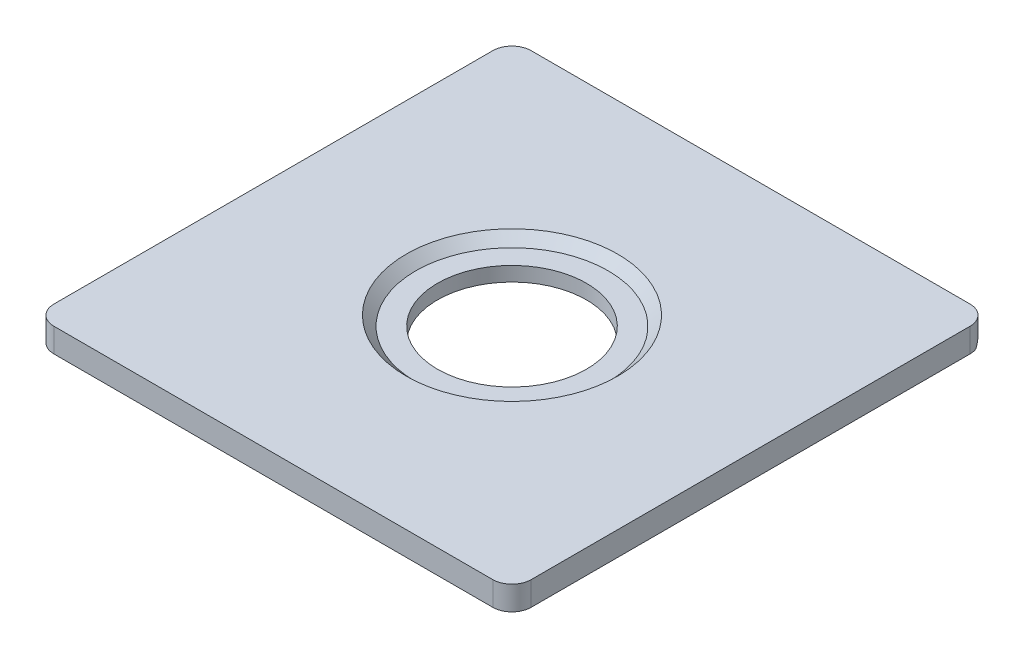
ISO-10303-21;
HEADER;
FILE_DESCRIPTION(('STEP AP214'),'2;1');
FILE_NAME('part.step','',(''),(''),'','','');
FILE_SCHEMA(('AUTOMOTIVE_DESIGN { 1 0 10303 214 1 1 1 1 }'));
ENDSEC;
DATA;
#1=APPLICATION_CONTEXT('core data for automotive mechanical design processes');
#2=APPLICATION_PROTOCOL_DEFINITION('international standard','automotive_design',2000,#1);
#3=PRODUCT_CONTEXT('',#1,'mechanical');
#4=PRODUCT('Part','Part','',(#3));
#5=PRODUCT_RELATED_PRODUCT_CATEGORY('part','',(#4));
#6=PRODUCT_DEFINITION_FORMATION('','',#4);
#7=PRODUCT_DEFINITION_CONTEXT('part definition',#1,'design');
#8=PRODUCT_DEFINITION('design','',#6,#7);
#9=PRODUCT_DEFINITION_SHAPE('','',#8);
#10=(LENGTH_UNIT() NAMED_UNIT(*) SI_UNIT(.MILLI.,.METRE.));
#11=(NAMED_UNIT(*) PLANE_ANGLE_UNIT() SI_UNIT($,.RADIAN.));
#12=(NAMED_UNIT(*) SI_UNIT($,.STERADIAN.) SOLID_ANGLE_UNIT());
#13=UNCERTAINTY_MEASURE_WITH_UNIT(LENGTH_MEASURE(1.E-05),#10,'distance_accuracy_value','');
#14=(GEOMETRIC_REPRESENTATION_CONTEXT(3) GLOBAL_UNCERTAINTY_ASSIGNED_CONTEXT((#13)) GLOBAL_UNIT_ASSIGNED_CONTEXT((#10,
#11,#12)) REPRESENTATION_CONTEXT('',''));
#15=CARTESIAN_POINT('',(0.,0.,0.));
#16=DIRECTION('',(0.,0.,1.));
#17=DIRECTION('',(1.,0.,0.));
#18=AXIS2_PLACEMENT_3D('',#15,#16,#17);
#19=CARTESIAN_POINT('',(0.,2.5,0.));
#20=DIRECTION('',(0.,-1.,0.));
#21=DIRECTION('',(0.,0.,-1.));
#22=AXIS2_PLACEMENT_3D('',#19,#20,#21);
#23=CYLINDRICAL_SURFACE('',#22,15.5);
#24=CARTESIAN_POINT('',(0.,-2.5,0.));
#25=DIRECTION('',(0.,1.,0.));
#26=DIRECTION('',(0.,0.,1.));
#27=AXIS2_PLACEMENT_3D('',#24,#25,#26);
#28=CIRCLE('',#27,15.5);
#29=CARTESIAN_POINT('',(0.,-2.5,15.5));
#30=VERTEX_POINT('',#29);
#31=EDGE_CURVE('E139',#30,#30,#28,.T.);
#32=ORIENTED_EDGE('',*,*,#31,.F.);
#33=EDGE_LOOP('',(#32));
#34=FACE_BOUND('',#33,.T.);
#35=CARTESIAN_POINT('',(0.,0.5,0.));
#36=DIRECTION('',(0.,1.,0.));
#37=DIRECTION('',(0.,0.,1.));
#38=AXIS2_PLACEMENT_3D('',#35,#36,#37);
#39=CIRCLE('',#38,15.5);
#40=CARTESIAN_POINT('',(0.,0.5,15.5));
#41=VERTEX_POINT('',#40);
#42=EDGE_CURVE('E143',#41,#41,#39,.T.);
#43=ORIENTED_EDGE('',*,*,#42,.T.);
#44=EDGE_LOOP('',(#43));
#45=FACE_BOUND('',#44,.T.);
#46=ADVANCED_FACE('F35',(#34,#45),#23,.F.);
#47=CARTESIAN_POINT('',(0.,2.5,0.));
#48=DIRECTION('',(0.,1.,0.));
#49=DIRECTION('',(0.,0.,1.));
#50=AXIS2_PLACEMENT_3D('',#47,#48,#49);
#51=PLANE('',#50);
#52=CARTESIAN_POINT('',(0.,2.5,0.));
#53=DIRECTION('',(0.,1.,0.));
#54=DIRECTION('',(0.,0.,1.));
#55=AXIS2_PLACEMENT_3D('',#52,#53,#54);
#56=CIRCLE('',#55,22.);
#57=CARTESIAN_POINT('',(0.,2.5,22.));
#58=VERTEX_POINT('',#57);
#59=EDGE_CURVE('E147',#58,#58,#56,.F.);
#60=ORIENTED_EDGE('',*,*,#59,.T.);
#61=EDGE_LOOP('',(#60));
#62=FACE_BOUND('',#61,.T.);
#63=DIRECTION('',(-1.,0.,0.));
#64=VECTOR('',#63,1.);
#65=CARTESIAN_POINT('',(-49.65,2.5,-49.65));
#66=LINE('',#65,#64);
#67=CARTESIAN_POINT('',(45.65,2.5,-49.65));
#68=VERTEX_POINT('',#67);
#69=CARTESIAN_POINT('',(-45.65,2.5,-49.65));
#70=VERTEX_POINT('',#69);
#71=EDGE_CURVE('E194',#68,#70,#66,.T.);
#72=ORIENTED_EDGE('',*,*,#71,.T.);
#73=CARTESIAN_POINT('',(-45.65,2.5,-45.65));
#74=DIRECTION('',(0.,1.,0.));
#75=DIRECTION('',(0.,0.,1.));
#76=AXIS2_PLACEMENT_3D('',#73,#74,#75);
#77=CIRCLE('',#76,4.);
#78=CARTESIAN_POINT('',(-49.65,2.5,-45.65));
#79=VERTEX_POINT('',#78);
#80=EDGE_CURVE('E173',#70,#79,#77,.T.);
#81=ORIENTED_EDGE('',*,*,#80,.T.);
#82=DIRECTION('',(0.,0.,1.));
#83=VECTOR('',#82,1.);
#84=CARTESIAN_POINT('',(-49.65,2.5,-49.65));
#85=LINE('',#84,#83);
#86=CARTESIAN_POINT('',(-49.65,2.5,45.65));
#87=VERTEX_POINT('',#86);
#88=EDGE_CURVE('E126',#79,#87,#85,.T.);
#89=ORIENTED_EDGE('',*,*,#88,.T.);
#90=CARTESIAN_POINT('',(-45.65,2.5,45.65));
#91=DIRECTION('',(0.,1.,0.));
#92=DIRECTION('',(0.,0.,1.));
#93=AXIS2_PLACEMENT_3D('',#90,#91,#92);
#94=CIRCLE('',#93,4.);
#95=CARTESIAN_POINT('',(-45.65,2.5,49.65));
#96=VERTEX_POINT('',#95);
#97=EDGE_CURVE('E55',#87,#96,#94,.T.);
#98=ORIENTED_EDGE('',*,*,#97,.T.);
#99=DIRECTION('',(1.,0.,0.));
#100=VECTOR('',#99,1.);
#101=CARTESIAN_POINT('',(-49.65,2.5,49.65));
#102=LINE('',#101,#100);
#103=CARTESIAN_POINT('',(45.65,2.5,49.65));
#104=VERTEX_POINT('',#103);
#105=EDGE_CURVE('E151',#96,#104,#102,.T.);
#106=ORIENTED_EDGE('',*,*,#105,.T.);
#107=CARTESIAN_POINT('',(45.65,2.5,45.65));
#108=DIRECTION('',(0.,1.,0.));
#109=DIRECTION('',(0.,0.,1.));
#110=AXIS2_PLACEMENT_3D('',#107,#108,#109);
#111=CIRCLE('',#110,4.);
#112=CARTESIAN_POINT('',(49.65,2.5,45.65));
#113=VERTEX_POINT('',#112);
#114=EDGE_CURVE('E169',#104,#113,#111,.T.);
#115=ORIENTED_EDGE('',*,*,#114,.T.);
#116=DIRECTION('',(0.,0.,-1.));
#117=VECTOR('',#116,1.);
#118=CARTESIAN_POINT('',(49.65,2.5,-49.65));
#119=LINE('',#118,#117);
#120=CARTESIAN_POINT('',(49.65,2.5,-45.65));
#121=VERTEX_POINT('',#120);
#122=EDGE_CURVE('E136',#113,#121,#119,.T.);
#123=ORIENTED_EDGE('',*,*,#122,.T.);
#124=CARTESIAN_POINT('',(45.65,2.5,-45.65));
#125=DIRECTION('',(0.,1.,0.));
#126=DIRECTION('',(0.,0.,1.));
#127=AXIS2_PLACEMENT_3D('',#124,#125,#126);
#128=CIRCLE('',#127,4.);
#129=EDGE_CURVE('E171',#121,#68,#128,.T.);
#130=ORIENTED_EDGE('',*,*,#129,.T.);
#131=EDGE_LOOP('',(#72,#81,#89,#98,#106,#115,#123,#130));
#132=FACE_BOUND('',#131,.T.);
#133=ADVANCED_FACE('F201',(#62,#132),#51,.T.);
#134=CARTESIAN_POINT('',(0.,-2.5,0.));
#135=DIRECTION('',(0.,1.,0.));
#136=DIRECTION('',(0.,0.,1.));
#137=AXIS2_PLACEMENT_3D('',#134,#135,#136);
#138=PLANE('',#137);
#139=DIRECTION('',(0.,0.,1.));
#140=VECTOR('',#139,1.);
#141=CARTESIAN_POINT('',(-49.65,-2.5,-49.65));
#142=LINE('',#141,#140);
#143=CARTESIAN_POINT('',(-49.65,-2.5,-45.65));
#144=VERTEX_POINT('',#143);
#145=CARTESIAN_POINT('',(-49.65,-2.5,45.65));
#146=VERTEX_POINT('',#145);
#147=EDGE_CURVE('E124',#144,#146,#142,.T.);
#148=ORIENTED_EDGE('',*,*,#147,.F.);
#149=CARTESIAN_POINT('',(-45.65,-2.5,-45.65));
#150=DIRECTION('',(0.,1.,0.));
#151=DIRECTION('',(0.,0.,1.));
#152=AXIS2_PLACEMENT_3D('',#149,#150,#151);
#153=CIRCLE('',#152,4.);
#154=CARTESIAN_POINT('',(-49.3580992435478,-2.5,-47.15));
#155=VERTEX_POINT('',#154);
#156=EDGE_CURVE('E106',#144,#155,#153,.F.);
#157=ORIENTED_EDGE('',*,*,#156,.T.);
#158=DIRECTION('',(1.,0.,0.));
#159=VECTOR('',#158,1.);
#160=CARTESIAN_POINT('',(0.,-2.5,-47.15));
#161=LINE('',#160,#159);
#162=CARTESIAN_POINT('',(49.3580992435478,-2.5,-47.15));
#163=VERTEX_POINT('',#162);
#164=EDGE_CURVE('E154',#155,#163,#161,.T.);
#165=ORIENTED_EDGE('',*,*,#164,.T.);
#166=CARTESIAN_POINT('',(45.65,-2.5,-45.65));
#167=DIRECTION('',(0.,1.,0.));
#168=DIRECTION('',(0.,0.,1.));
#169=AXIS2_PLACEMENT_3D('',#166,#167,#168);
#170=CIRCLE('',#169,4.);
#171=CARTESIAN_POINT('',(49.65,-2.5,-45.65));
#172=VERTEX_POINT('',#171);
#173=EDGE_CURVE('E118',#163,#172,#170,.F.);
#174=ORIENTED_EDGE('',*,*,#173,.T.);
#175=DIRECTION('',(0.,0.,-1.));
#176=VECTOR('',#175,1.);
#177=CARTESIAN_POINT('',(49.65,-2.5,-49.65));
#178=LINE('',#177,#176);
#179=CARTESIAN_POINT('',(49.65,-2.5,45.65));
#180=VERTEX_POINT('',#179);
#181=EDGE_CURVE('E134',#180,#172,#178,.T.);
#182=ORIENTED_EDGE('',*,*,#181,.F.);
#183=CARTESIAN_POINT('',(45.65,-2.5,45.65));
#184=DIRECTION('',(0.,1.,0.));
#185=DIRECTION('',(0.,0.,1.));
#186=AXIS2_PLACEMENT_3D('',#183,#184,#185);
#187=CIRCLE('',#186,4.);
#188=CARTESIAN_POINT('',(45.65,-2.5,49.65));
#189=VERTEX_POINT('',#188);
#190=EDGE_CURVE('E158',#180,#189,#187,.F.);
#191=ORIENTED_EDGE('',*,*,#190,.T.);
#192=DIRECTION('',(1.,0.,0.));
#193=VECTOR('',#192,1.);
#194=CARTESIAN_POINT('',(-49.65,-2.5,49.65));
#195=LINE('',#194,#193);
#196=CARTESIAN_POINT('',(-45.65,-2.5,49.65));
#197=VERTEX_POINT('',#196);
#198=EDGE_CURVE('E133',#197,#189,#195,.T.);
#199=ORIENTED_EDGE('',*,*,#198,.F.);
#200=CARTESIAN_POINT('',(-45.65,-2.5,45.65));
#201=DIRECTION('',(0.,1.,0.));
#202=DIRECTION('',(0.,0.,1.));
#203=AXIS2_PLACEMENT_3D('',#200,#201,#202);
#204=CIRCLE('',#203,4.);
#205=EDGE_CURVE('E127',#197,#146,#204,.F.);
#206=ORIENTED_EDGE('',*,*,#205,.T.);
#207=EDGE_LOOP('',(#148,#157,#165,#174,#182,#191,#199,#206));
#208=FACE_BOUND('',#207,.T.);
#209=ORIENTED_EDGE('',*,*,#31,.T.);
#210=EDGE_LOOP('',(#209));
#211=FACE_BOUND('',#210,.T.);
#212=ADVANCED_FACE('F130',(#208,#211),#138,.F.);
#213=CARTESIAN_POINT('',(49.65,2.5,-49.65));
#214=DIRECTION('',(-1.,0.,0.));
#215=DIRECTION('',(0.,0.,1.));
#216=AXIS2_PLACEMENT_3D('',#213,#214,#215);
#217=PLANE('',#216);
#218=ORIENTED_EDGE('',*,*,#181,.T.);
#219=DIRECTION('',(0.,-1.,0.));
#220=VECTOR('',#219,1.);
#221=CARTESIAN_POINT('',(49.65,2.5,-45.65));
#222=LINE('',#221,#220);
#223=EDGE_CURVE('E178',#172,#121,#222,.F.);
#224=ORIENTED_EDGE('',*,*,#223,.T.);
#225=ORIENTED_EDGE('',*,*,#122,.F.);
#226=DIRECTION('',(0.,-1.,0.));
#227=VECTOR('',#226,1.);
#228=CARTESIAN_POINT('',(49.65,2.5,45.65));
#229=LINE('',#228,#227);
#230=EDGE_CURVE('E175',#113,#180,#229,.T.);
#231=ORIENTED_EDGE('',*,*,#230,.T.);
#232=EDGE_LOOP('',(#218,#224,#225,#231));
#233=FACE_BOUND('',#232,.T.);
#234=ADVANCED_FACE('F190',(#233),#217,.F.);
#235=CARTESIAN_POINT('',(-49.65,2.5,-49.65));
#236=DIRECTION('',(0.,0.,1.));
#237=DIRECTION('',(1.,0.,0.));
#238=AXIS2_PLACEMENT_3D('',#235,#236,#237);
#239=PLANE('',#238);
#240=DIRECTION('',(-1.,0.,0.));
#241=VECTOR('',#240,1.);
#242=CARTESIAN_POINT('',(-49.65,0.,-49.65));
#243=LINE('',#242,#241);
#244=CARTESIAN_POINT('',(45.65,0.,-49.65));
#245=VERTEX_POINT('',#244);
#246=CARTESIAN_POINT('',(-45.65,0.,-49.65));
#247=VERTEX_POINT('',#246);
#248=EDGE_CURVE('E150',#245,#247,#243,.T.);
#249=ORIENTED_EDGE('',*,*,#248,.T.);
#250=DIRECTION('',(0.,-1.,0.));
#251=VECTOR('',#250,1.);
#252=CARTESIAN_POINT('',(-45.65,2.5,-49.65));
#253=LINE('',#252,#251);
#254=EDGE_CURVE('E166',#247,#70,#253,.F.);
#255=ORIENTED_EDGE('',*,*,#254,.T.);
#256=ORIENTED_EDGE('',*,*,#71,.F.);
#257=DIRECTION('',(0.,-1.,0.));
#258=VECTOR('',#257,1.);
#259=CARTESIAN_POINT('',(45.65,2.5,-49.65));
#260=LINE('',#259,#258);
#261=EDGE_CURVE('E163',#68,#245,#260,.T.);
#262=ORIENTED_EDGE('',*,*,#261,.T.);
#263=EDGE_LOOP('',(#249,#255,#256,#262));
#264=FACE_BOUND('',#263,.T.);
#265=ADVANCED_FACE('F220',(#264),#239,.F.);
#266=CARTESIAN_POINT('',(-49.65,2.5,-49.65));
#267=DIRECTION('',(1.,0.,0.));
#268=DIRECTION('',(0.,0.,-1.));
#269=AXIS2_PLACEMENT_3D('',#266,#267,#268);
#270=PLANE('',#269);
#271=ORIENTED_EDGE('',*,*,#88,.F.);
#272=DIRECTION('',(0.,-1.,0.));
#273=VECTOR('',#272,1.);
#274=CARTESIAN_POINT('',(-49.65,2.5,-45.65));
#275=LINE('',#274,#273);
#276=EDGE_CURVE('E110',#79,#144,#275,.T.);
#277=ORIENTED_EDGE('',*,*,#276,.T.);
#278=ORIENTED_EDGE('',*,*,#147,.T.);
#279=DIRECTION('',(0.,-1.,0.));
#280=VECTOR('',#279,1.);
#281=CARTESIAN_POINT('',(-49.65,2.5,45.65));
#282=LINE('',#281,#280);
#283=EDGE_CURVE('E128',#146,#87,#282,.F.);
#284=ORIENTED_EDGE('',*,*,#283,.T.);
#285=EDGE_LOOP('',(#271,#277,#278,#284));
#286=FACE_BOUND('',#285,.T.);
#287=ADVANCED_FACE('F123',(#286),#270,.F.);
#288=CARTESIAN_POINT('',(-49.65,2.5,49.65));
#289=DIRECTION('',(0.,0.,-1.));
#290=DIRECTION('',(-1.,0.,0.));
#291=AXIS2_PLACEMENT_3D('',#288,#289,#290);
#292=PLANE('',#291);
#293=ORIENTED_EDGE('',*,*,#198,.T.);
#294=DIRECTION('',(0.,-1.,0.));
#295=VECTOR('',#294,1.);
#296=CARTESIAN_POINT('',(45.65,2.5,49.65));
#297=LINE('',#296,#295);
#298=EDGE_CURVE('E11',#189,#104,#297,.F.);
#299=ORIENTED_EDGE('',*,*,#298,.T.);
#300=ORIENTED_EDGE('',*,*,#105,.F.);
#301=DIRECTION('',(0.,-1.,0.));
#302=VECTOR('',#301,1.);
#303=CARTESIAN_POINT('',(-45.65,2.5,49.65));
#304=LINE('',#303,#302);
#305=EDGE_CURVE('E43',#96,#197,#304,.T.);
#306=ORIENTED_EDGE('',*,*,#305,.T.);
#307=EDGE_LOOP('',(#293,#299,#300,#306));
#308=FACE_BOUND('',#307,.T.);
#309=ADVANCED_FACE('F181',(#308),#292,.F.);
#310=CARTESIAN_POINT('',(0.,0.5,0.));
#311=DIRECTION('',(0.,1.,0.));
#312=DIRECTION('',(0.,0.,1.));
#313=AXIS2_PLACEMENT_3D('',#310,#311,#312);
#314=PLANE('',#313);
#315=ORIENTED_EDGE('',*,*,#42,.F.);
#316=EDGE_LOOP('',(#315));
#317=FACE_BOUND('',#316,.T.);
#318=CARTESIAN_POINT('',(0.,0.5,0.));
#319=DIRECTION('',(0.,1.,0.));
#320=DIRECTION('',(0.,0.,1.));
#321=AXIS2_PLACEMENT_3D('',#318,#319,#320);
#322=CIRCLE('',#321,20.);
#323=CARTESIAN_POINT('',(0.,0.5,20.));
#324=VERTEX_POINT('',#323);
#325=EDGE_CURVE('E146',#324,#324,#322,.T.);
#326=ORIENTED_EDGE('',*,*,#325,.T.);
#327=EDGE_LOOP('',(#326));
#328=FACE_BOUND('',#327,.T.);
#329=ADVANCED_FACE('F217',(#317,#328),#314,.T.);
#330=CARTESIAN_POINT('',(0.,0.499999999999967,0.));
#331=DIRECTION('',(0.,1.,0.));
#332=DIRECTION('',(0.,0.,1.));
#333=AXIS2_PLACEMENT_3D('',#330,#331,#332);
#334=CONICAL_SURFACE('',#333,20.,0.785398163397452);
#335=ORIENTED_EDGE('',*,*,#59,.F.);
#336=EDGE_LOOP('',(#335));
#337=FACE_BOUND('',#336,.T.);
#338=ORIENTED_EDGE('',*,*,#325,.F.);
#339=EDGE_LOOP('',(#338));
#340=FACE_BOUND('',#339,.T.);
#341=ADVANCED_FACE('F227',(#337,#340),#334,.F.);
#342=CARTESIAN_POINT('',(-49.65,0.,-49.65));
#343=DIRECTION('',(0.,0.707106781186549,0.707106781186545));
#344=DIRECTION('',(-1.,0.,0.));
#345=AXIS2_PLACEMENT_3D('',#342,#343,#344);
#346=PLANE('',#345);
#347=ORIENTED_EDGE('',*,*,#164,.F.);
#348=CARTESIAN_POINT('',(-45.65,-3.99999999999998,-45.65));
#349=DIRECTION('',(0.,0.707106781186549,0.707106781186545));
#350=DIRECTION('',(0.,-0.707106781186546,0.707106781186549));
#351=AXIS2_PLACEMENT_3D('',#348,#349,#350);
#352=ELLIPSE('',#351,5.65685424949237,4.);
#353=EDGE_CURVE('E112',#155,#247,#352,.F.);
#354=ORIENTED_EDGE('',*,*,#353,.T.);
#355=ORIENTED_EDGE('',*,*,#248,.F.);
#356=CARTESIAN_POINT('',(45.65,-3.99999999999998,-45.65));
#357=DIRECTION('',(0.,0.707106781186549,0.707106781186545));
#358=DIRECTION('',(0.,-0.707106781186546,0.707106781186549));
#359=AXIS2_PLACEMENT_3D('',#356,#357,#358);
#360=ELLIPSE('',#359,5.65685424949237,4.);
#361=EDGE_CURVE('E117',#245,#163,#360,.F.);
#362=ORIENTED_EDGE('',*,*,#361,.T.);
#363=EDGE_LOOP('',(#347,#354,#355,#362));
#364=FACE_BOUND('',#363,.T.);
#365=ADVANCED_FACE('F233',(#364),#346,.F.);
#366=CARTESIAN_POINT('',(-45.65,2.5,-45.65));
#367=DIRECTION('',(0.,-1.,0.));
#368=DIRECTION('',(0.,0.,-1.));
#369=AXIS2_PLACEMENT_3D('',#366,#367,#368);
#370=CYLINDRICAL_SURFACE('',#369,4.);
#371=ORIENTED_EDGE('',*,*,#80,.F.);
#372=ORIENTED_EDGE('',*,*,#254,.F.);
#373=ORIENTED_EDGE('',*,*,#353,.F.);
#374=ORIENTED_EDGE('',*,*,#156,.F.);
#375=ORIENTED_EDGE('',*,*,#276,.F.);
#376=EDGE_LOOP('',(#371,#372,#373,#374,#375));
#377=FACE_BOUND('',#376,.T.);
#378=ADVANCED_FACE('F109',(#377),#370,.T.);
#379=CARTESIAN_POINT('',(45.65,2.5,-45.65));
#380=DIRECTION('',(0.,-1.,0.));
#381=DIRECTION('',(0.,0.,-1.));
#382=AXIS2_PLACEMENT_3D('',#379,#380,#381);
#383=CYLINDRICAL_SURFACE('',#382,4.);
#384=ORIENTED_EDGE('',*,*,#129,.F.);
#385=ORIENTED_EDGE('',*,*,#223,.F.);
#386=ORIENTED_EDGE('',*,*,#173,.F.);
#387=ORIENTED_EDGE('',*,*,#361,.F.);
#388=ORIENTED_EDGE('',*,*,#261,.F.);
#389=EDGE_LOOP('',(#384,#385,#386,#387,#388));
#390=FACE_BOUND('',#389,.T.);
#391=ADVANCED_FACE('F242',(#390),#383,.T.);
#392=CARTESIAN_POINT('',(45.65,2.5,45.65));
#393=DIRECTION('',(0.,-1.,0.));
#394=DIRECTION('',(0.,0.,-1.));
#395=AXIS2_PLACEMENT_3D('',#392,#393,#394);
#396=CYLINDRICAL_SURFACE('',#395,4.);
#397=ORIENTED_EDGE('',*,*,#114,.F.);
#398=ORIENTED_EDGE('',*,*,#298,.F.);
#399=ORIENTED_EDGE('',*,*,#190,.F.);
#400=ORIENTED_EDGE('',*,*,#230,.F.);
#401=EDGE_LOOP('',(#397,#398,#399,#400));
#402=FACE_BOUND('',#401,.T.);
#403=ADVANCED_FACE('F187',(#402),#396,.T.);
#404=CARTESIAN_POINT('',(-45.65,2.5,45.65));
#405=DIRECTION('',(0.,-1.,0.));
#406=DIRECTION('',(0.,0.,-1.));
#407=AXIS2_PLACEMENT_3D('',#404,#405,#406);
#408=CYLINDRICAL_SURFACE('',#407,4.);
#409=ORIENTED_EDGE('',*,*,#97,.F.);
#410=ORIENTED_EDGE('',*,*,#283,.F.);
#411=ORIENTED_EDGE('',*,*,#205,.F.);
#412=ORIENTED_EDGE('',*,*,#305,.F.);
#413=EDGE_LOOP('',(#409,#410,#411,#412));
#414=FACE_BOUND('',#413,.T.);
#415=ADVANCED_FACE('F37',(#414),#408,.T.);
#416=CLOSED_SHELL('',(#46,#133,#212,#234,#265,#287,#309,#329,#341,#365,#378,#391,#403,#415));
#417=MANIFOLD_SOLID_BREP('B2',#416);
#418=ADVANCED_BREP_SHAPE_REPRESENTATION('',(#18,#417),#14);
#419=SHAPE_DEFINITION_REPRESENTATION(#9,#418);
ENDSEC;
END-ISO-10303-21;
